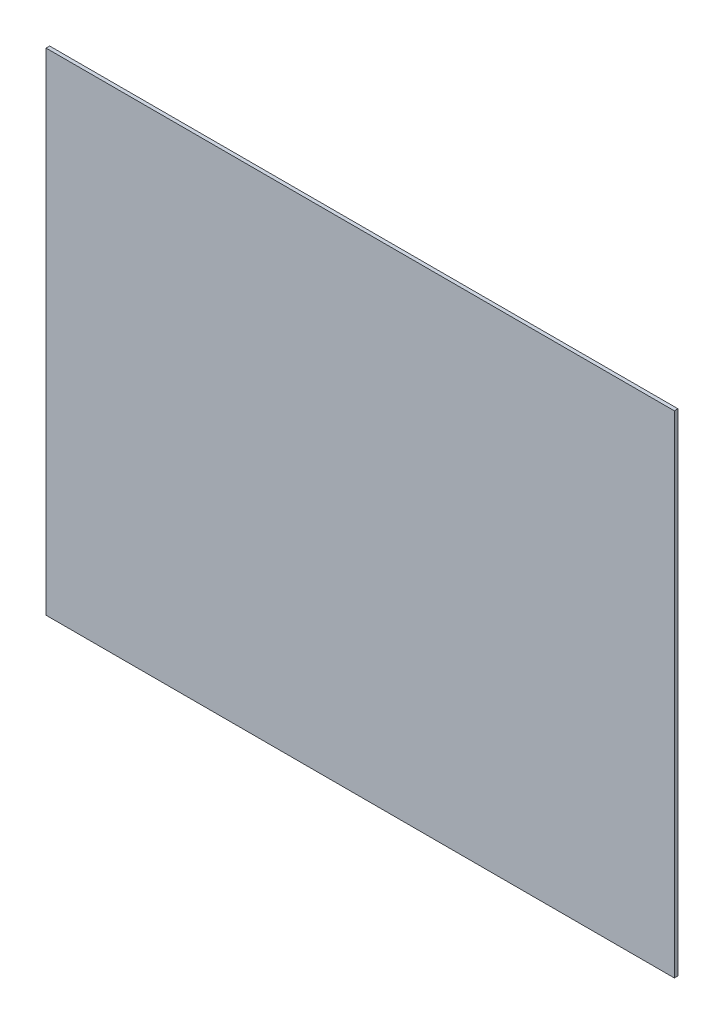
from build123d import *

# Parameters (mm, degrees)
SKETCH1_W           = 349.25
SKETCH1_H           = 273.05
BOSS_EXTRUDE1_DEPTH = 2


with BuildPart() as part:
    # Sketch1 → Boss-Extrude1 (new body)
    with BuildSketch(Plane.XY):
        with Locations((140, -84)):
            Rectangle(SKETCH1_W, SKETCH1_H)
    extrude(amount=BOSS_EXTRUDE1_DEPTH)


solid = part.part
